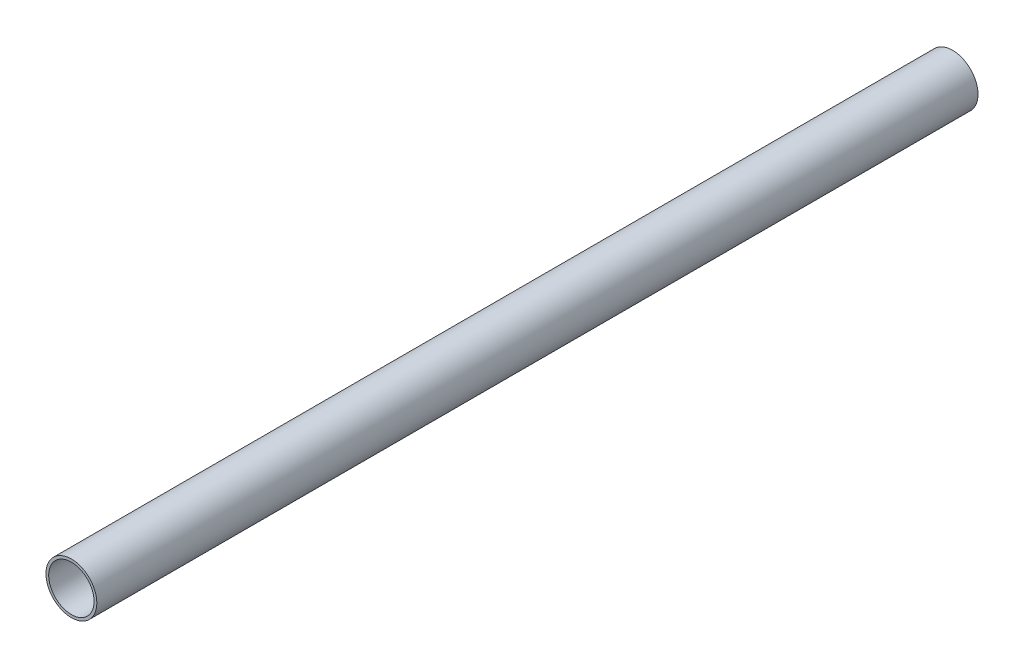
ISO-10303-21;
HEADER;
FILE_DESCRIPTION(('STEP AP214'),'2;1');
FILE_NAME('part.step','',(''),(''),'','','');
FILE_SCHEMA(('AUTOMOTIVE_DESIGN { 1 0 10303 214 1 1 1 1 }'));
ENDSEC;
DATA;
#1=APPLICATION_CONTEXT('core data for automotive mechanical design processes');
#2=APPLICATION_PROTOCOL_DEFINITION('international standard','automotive_design',2000,#1);
#3=PRODUCT_CONTEXT('',#1,'mechanical');
#4=PRODUCT('Part','Part','',(#3));
#5=PRODUCT_RELATED_PRODUCT_CATEGORY('part','',(#4));
#6=PRODUCT_DEFINITION_FORMATION('','',#4);
#7=PRODUCT_DEFINITION_CONTEXT('part definition',#1,'design');
#8=PRODUCT_DEFINITION('design','',#6,#7);
#9=PRODUCT_DEFINITION_SHAPE('','',#8);
#10=(LENGTH_UNIT() NAMED_UNIT(*) SI_UNIT(.MILLI.,.METRE.));
#11=(NAMED_UNIT(*) PLANE_ANGLE_UNIT() SI_UNIT($,.RADIAN.));
#12=(NAMED_UNIT(*) SI_UNIT($,.STERADIAN.) SOLID_ANGLE_UNIT());
#13=UNCERTAINTY_MEASURE_WITH_UNIT(LENGTH_MEASURE(1.E-05),#10,'distance_accuracy_value','');
#14=(GEOMETRIC_REPRESENTATION_CONTEXT(3) GLOBAL_UNCERTAINTY_ASSIGNED_CONTEXT((#13)) GLOBAL_UNIT_ASSIGNED_CONTEXT((#10,
#11,#12)) REPRESENTATION_CONTEXT('',''));
#15=CARTESIAN_POINT('',(0.,0.,0.));
#16=DIRECTION('',(0.,0.,1.));
#17=DIRECTION('',(1.,0.,0.));
#18=AXIS2_PLACEMENT_3D('',#15,#16,#17);
#19=CARTESIAN_POINT('',(0.,0.,485.));
#20=DIRECTION('',(0.,0.,1.));
#21=DIRECTION('',(1.,0.,0.));
#22=AXIS2_PLACEMENT_3D('',#19,#20,#21);
#23=PLANE('',#22);
#24=CARTESIAN_POINT('',(0.,0.,485.));
#25=DIRECTION('',(0.,0.,1.));
#26=DIRECTION('',(1.,0.,0.));
#27=AXIS2_PLACEMENT_3D('',#24,#25,#26);
#28=CIRCLE('',#27,14.);
#29=CARTESIAN_POINT('',(14.,0.,485.));
#30=VERTEX_POINT('',#29);
#31=EDGE_CURVE('E11',#30,#30,#28,.T.);
#32=ORIENTED_EDGE('',*,*,#31,.T.);
#33=EDGE_LOOP('',(#32));
#34=FACE_BOUND('',#33,.T.);
#35=CARTESIAN_POINT('',(0.,0.,485.));
#36=DIRECTION('',(0.,0.,1.));
#37=DIRECTION('',(1.,0.,0.));
#38=AXIS2_PLACEMENT_3D('',#35,#36,#37);
#39=CIRCLE('',#38,12.5);
#40=CARTESIAN_POINT('',(12.5,0.,485.));
#41=VERTEX_POINT('',#40);
#42=EDGE_CURVE('E45',#41,#41,#39,.T.);
#43=ORIENTED_EDGE('',*,*,#42,.F.);
#44=EDGE_LOOP('',(#43));
#45=FACE_BOUND('',#44,.T.);
#46=ADVANCED_FACE('F34',(#34,#45),#23,.T.);
#47=CARTESIAN_POINT('',(0.,0.,0.));
#48=DIRECTION('',(0.,0.,1.));
#49=DIRECTION('',(1.,0.,0.));
#50=AXIS2_PLACEMENT_3D('',#47,#48,#49);
#51=PLANE('',#50);
#52=CARTESIAN_POINT('',(0.,0.,0.));
#53=DIRECTION('',(0.,0.,1.));
#54=DIRECTION('',(1.,0.,0.));
#55=AXIS2_PLACEMENT_3D('',#52,#53,#54);
#56=CIRCLE('',#55,14.);
#57=CARTESIAN_POINT('',(14.,0.,0.));
#58=VERTEX_POINT('',#57);
#59=EDGE_CURVE('E38',#58,#58,#56,.T.);
#60=ORIENTED_EDGE('',*,*,#59,.F.);
#61=EDGE_LOOP('',(#60));
#62=FACE_BOUND('',#61,.T.);
#63=CARTESIAN_POINT('',(0.,0.,0.));
#64=DIRECTION('',(0.,0.,1.));
#65=DIRECTION('',(1.,0.,0.));
#66=AXIS2_PLACEMENT_3D('',#63,#64,#65);
#67=CIRCLE('',#66,12.5);
#68=CARTESIAN_POINT('',(12.5,0.,0.));
#69=VERTEX_POINT('',#68);
#70=EDGE_CURVE('E47',#69,#69,#67,.T.);
#71=ORIENTED_EDGE('',*,*,#70,.T.);
#72=EDGE_LOOP('',(#71));
#73=FACE_BOUND('',#72,.T.);
#74=ADVANCED_FACE('F57',(#62,#73),#51,.F.);
#75=CARTESIAN_POINT('',(0.,0.,485.));
#76=DIRECTION('',(0.,0.,-1.));
#77=DIRECTION('',(-1.,0.,0.));
#78=AXIS2_PLACEMENT_3D('',#75,#76,#77);
#79=CYLINDRICAL_SURFACE('',#78,14.);
#80=ORIENTED_EDGE('',*,*,#31,.F.);
#81=EDGE_LOOP('',(#80));
#82=FACE_BOUND('',#81,.T.);
#83=ORIENTED_EDGE('',*,*,#59,.T.);
#84=EDGE_LOOP('',(#83));
#85=FACE_BOUND('',#84,.T.);
#86=ADVANCED_FACE('F36',(#82,#85),#79,.T.);
#87=CARTESIAN_POINT('',(0.,0.,485.));
#88=DIRECTION('',(0.,0.,-1.));
#89=DIRECTION('',(-1.,0.,0.));
#90=AXIS2_PLACEMENT_3D('',#87,#88,#89);
#91=CYLINDRICAL_SURFACE('',#90,12.5);
#92=ORIENTED_EDGE('',*,*,#42,.T.);
#93=EDGE_LOOP('',(#92));
#94=FACE_BOUND('',#93,.T.);
#95=ORIENTED_EDGE('',*,*,#70,.F.);
#96=EDGE_LOOP('',(#95));
#97=FACE_BOUND('',#96,.T.);
#98=ADVANCED_FACE('F53',(#94,#97),#91,.F.);
#99=CLOSED_SHELL('',(#46,#74,#86,#98));
#100=MANIFOLD_SOLID_BREP('B2',#99);
#101=ADVANCED_BREP_SHAPE_REPRESENTATION('',(#18,#100),#14);
#102=SHAPE_DEFINITION_REPRESENTATION(#9,#101);
ENDSEC;
END-ISO-10303-21;
